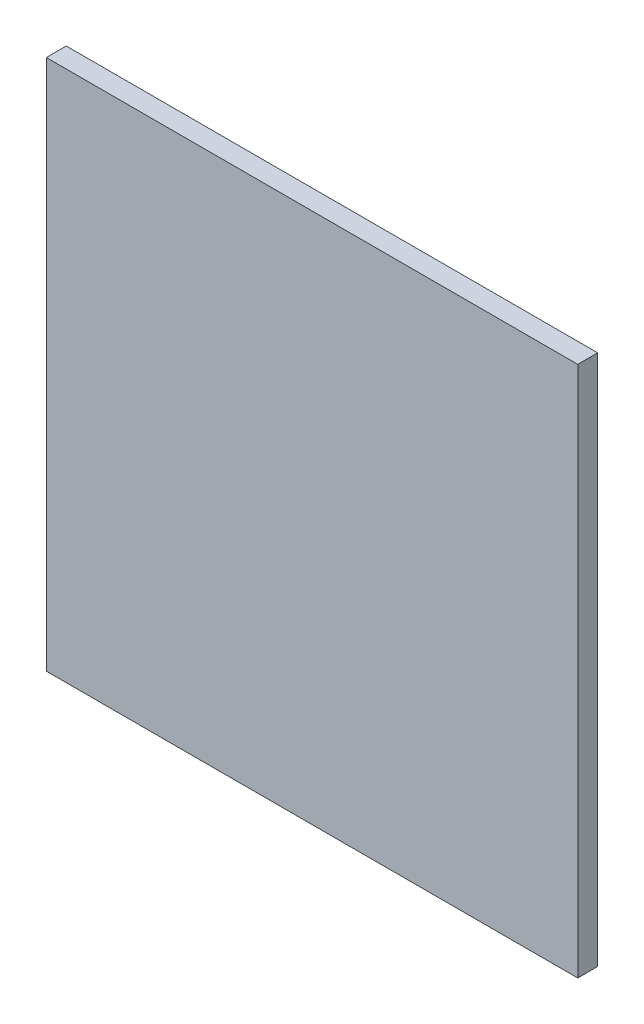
from build123d import *

# Parameters (mm, degrees)
CROQUIS1_W              = 400
CROQUIS1_H              = 400
SALIENTE_EXTRUIR1_DEPTH = 15


with BuildPart() as part:
    # Croquis1 → Saliente-Extruir1 (new body)
    with BuildSketch(Plane.XY):
        Rectangle(CROQUIS1_W, CROQUIS1_H)
    extrude(amount=SALIENTE_EXTRUIR1_DEPTH)


solid = part.part
